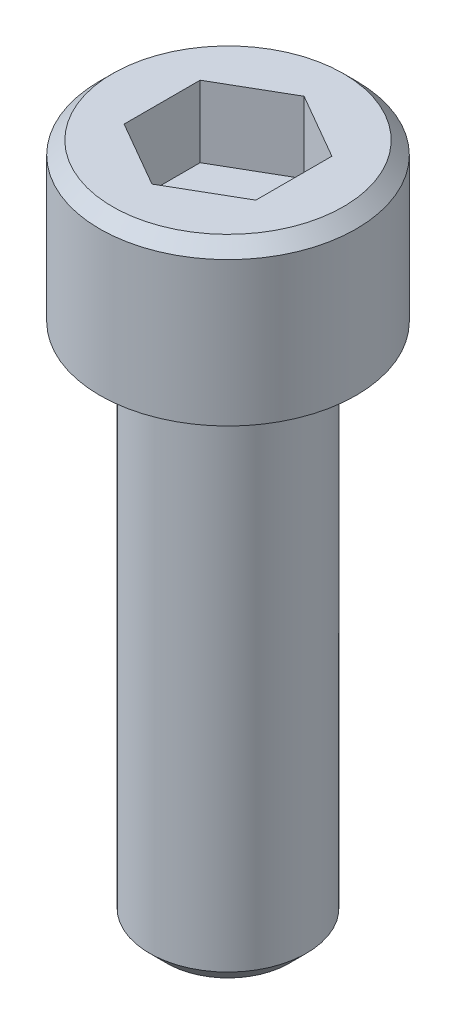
from build123d import *

# Parameters (mm, degrees)
CUT_EXTRUDE1_DEPTH = 1.2954


with BuildPart() as part:
    # Sketch1 → Base-Revolve (revolve)
    with BuildSketch(Plane.XY, mode=Mode.PRIVATE) as base_revolve_sk:
        Polygon((0, 0), (2.3241, 0), (2.3241, 2.61239), (2.09169, 2.8448), (0, 2.8448), align=None)
    revolve(base_revolve_sk.sketch.rotate(Axis((0, 0, 0), (0, 1, 0)), 90), axis=Axis((0, 0, 0), (0, 1, 0)))

    # Sketch2 → Boss-Revolve1 (revolve)
    with BuildSketch(Plane.XY, mode=Mode.PRIVATE) as boss_revolve1_sk:
        Polygon((0, -9.525), (1.10617, -9.525), (1.4224, -9.20877), (1.4224, 0), (0, 0), align=None)
    revolve(boss_revolve1_sk.sketch.rotate(Axis((0, 0, 0), (0, 1, 0)), 90), axis=Axis((0, 0, 0), (0, 1, 0)))

    # Sketch3 → Cut-Extrude1 (cut)
    with BuildSketch(Plane(origin=(0, 2.8448, 0), x_dir=(-1, 0, 0), z_dir=(0, 1, 0))):
        Polygon((1.1938, 0.689240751), (0, 1.378481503), (-1.1938, 0.689240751), (-1.1938, -0.689240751), (0, -1.378481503), (1.1938, -0.689240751), align=None)
    extrude(amount=-CUT_EXTRUDE1_DEPTH, mode=Mode.SUBTRACT)


solid = part.part
